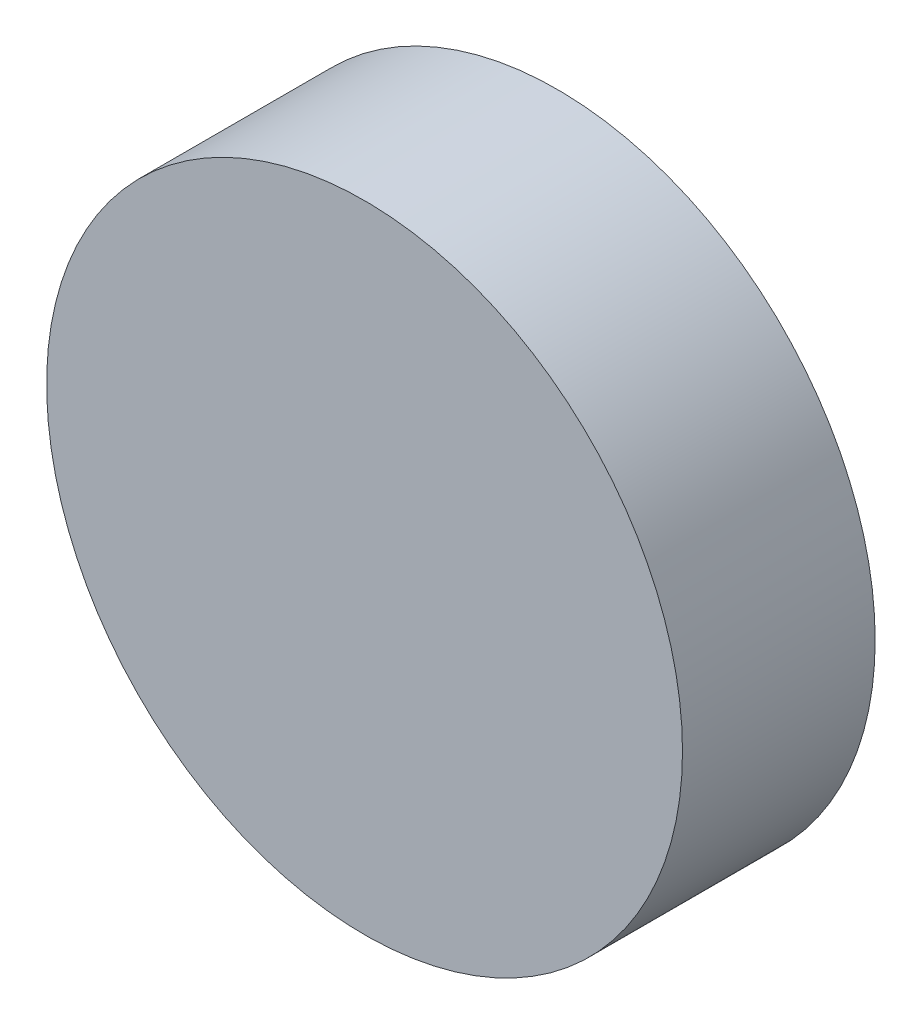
ISO-10303-21;
HEADER;
FILE_DESCRIPTION(('STEP AP214'),'2;1');
FILE_NAME('part.step','',(''),(''),'','','');
FILE_SCHEMA(('AUTOMOTIVE_DESIGN { 1 0 10303 214 1 1 1 1 }'));
ENDSEC;
DATA;
#1=APPLICATION_CONTEXT('core data for automotive mechanical design processes');
#2=APPLICATION_PROTOCOL_DEFINITION('international standard','automotive_design',2000,#1);
#3=PRODUCT_CONTEXT('',#1,'mechanical');
#4=PRODUCT('Part','Part','',(#3));
#5=PRODUCT_RELATED_PRODUCT_CATEGORY('part','',(#4));
#6=PRODUCT_DEFINITION_FORMATION('','',#4);
#7=PRODUCT_DEFINITION_CONTEXT('part definition',#1,'design');
#8=PRODUCT_DEFINITION('design','',#6,#7);
#9=PRODUCT_DEFINITION_SHAPE('','',#8);
#10=(LENGTH_UNIT() NAMED_UNIT(*) SI_UNIT(.MILLI.,.METRE.));
#11=(NAMED_UNIT(*) PLANE_ANGLE_UNIT() SI_UNIT($,.RADIAN.));
#12=(NAMED_UNIT(*) SI_UNIT($,.STERADIAN.) SOLID_ANGLE_UNIT());
#13=UNCERTAINTY_MEASURE_WITH_UNIT(LENGTH_MEASURE(1.E-05),#10,'distance_accuracy_value','');
#14=(GEOMETRIC_REPRESENTATION_CONTEXT(3) GLOBAL_UNCERTAINTY_ASSIGNED_CONTEXT((#13)) GLOBAL_UNIT_ASSIGNED_CONTEXT((#10,
#11,#12)) REPRESENTATION_CONTEXT('',''));
#15=CARTESIAN_POINT('',(0.,0.,0.));
#16=DIRECTION('',(0.,0.,1.));
#17=DIRECTION('',(1.,0.,0.));
#18=AXIS2_PLACEMENT_3D('',#15,#16,#17);
#19=CARTESIAN_POINT('',(3.24,1.065,1.2));
#20=DIRECTION('',(0.,0.,1.));
#21=DIRECTION('',(1.,0.,0.));
#22=AXIS2_PLACEMENT_3D('',#19,#20,#21);
#23=PLANE('',#22);
#24=CARTESIAN_POINT('',(3.24,1.065,1.2));
#25=DIRECTION('',(0.,0.,1.));
#26=DIRECTION('',(1.,0.,0.));
#27=AXIS2_PLACEMENT_3D('',#24,#25,#26);
#28=CIRCLE('',#27,0.33);
#29=CARTESIAN_POINT('',(3.57,1.065,1.2));
#30=VERTEX_POINT('',#29);
#31=EDGE_CURVE('E18',#30,#30,#28,.F.);
#32=ORIENTED_EDGE('',*,*,#31,.F.);
#33=EDGE_LOOP('',(#32));
#34=FACE_BOUND('',#33,.T.);
#35=ADVANCED_FACE('F15',(#34),#23,.T.);
#36=CARTESIAN_POINT('',(3.24,1.065,1.));
#37=DIRECTION('',(0.,0.,1.));
#38=DIRECTION('',(1.,0.,0.));
#39=AXIS2_PLACEMENT_3D('',#36,#37,#38);
#40=PLANE('',#39);
#41=CARTESIAN_POINT('',(3.24,1.065,1.));
#42=DIRECTION('',(0.,0.,1.));
#43=DIRECTION('',(1.,0.,0.));
#44=AXIS2_PLACEMENT_3D('',#41,#42,#43);
#45=CIRCLE('',#44,0.33);
#46=CARTESIAN_POINT('',(3.57,1.065,1.));
#47=VERTEX_POINT('',#46);
#48=EDGE_CURVE('E10',#47,#47,#45,.T.);
#49=ORIENTED_EDGE('',*,*,#48,.F.);
#50=EDGE_LOOP('',(#49));
#51=FACE_BOUND('',#50,.T.);
#52=ADVANCED_FACE('F30',(#51),#40,.F.);
#53=CARTESIAN_POINT('',(3.24,1.065,1.));
#54=DIRECTION('',(0.,0.,1.));
#55=DIRECTION('',(1.,0.,0.));
#56=AXIS2_PLACEMENT_3D('',#53,#54,#55);
#57=CYLINDRICAL_SURFACE('',#56,0.33);
#58=ORIENTED_EDGE('',*,*,#48,.T.);
#59=EDGE_LOOP('',(#58));
#60=FACE_BOUND('',#59,.T.);
#61=ORIENTED_EDGE('',*,*,#31,.T.);
#62=EDGE_LOOP('',(#61));
#63=FACE_BOUND('',#62,.T.);
#64=ADVANCED_FACE('F27',(#60,#63),#57,.T.);
#65=CLOSED_SHELL('',(#35,#52,#64));
#66=MANIFOLD_SOLID_BREP('B1',#65);
#67=ADVANCED_BREP_SHAPE_REPRESENTATION('',(#18,#66),#14);
#68=SHAPE_DEFINITION_REPRESENTATION(#9,#67);
ENDSEC;
END-ISO-10303-21;
